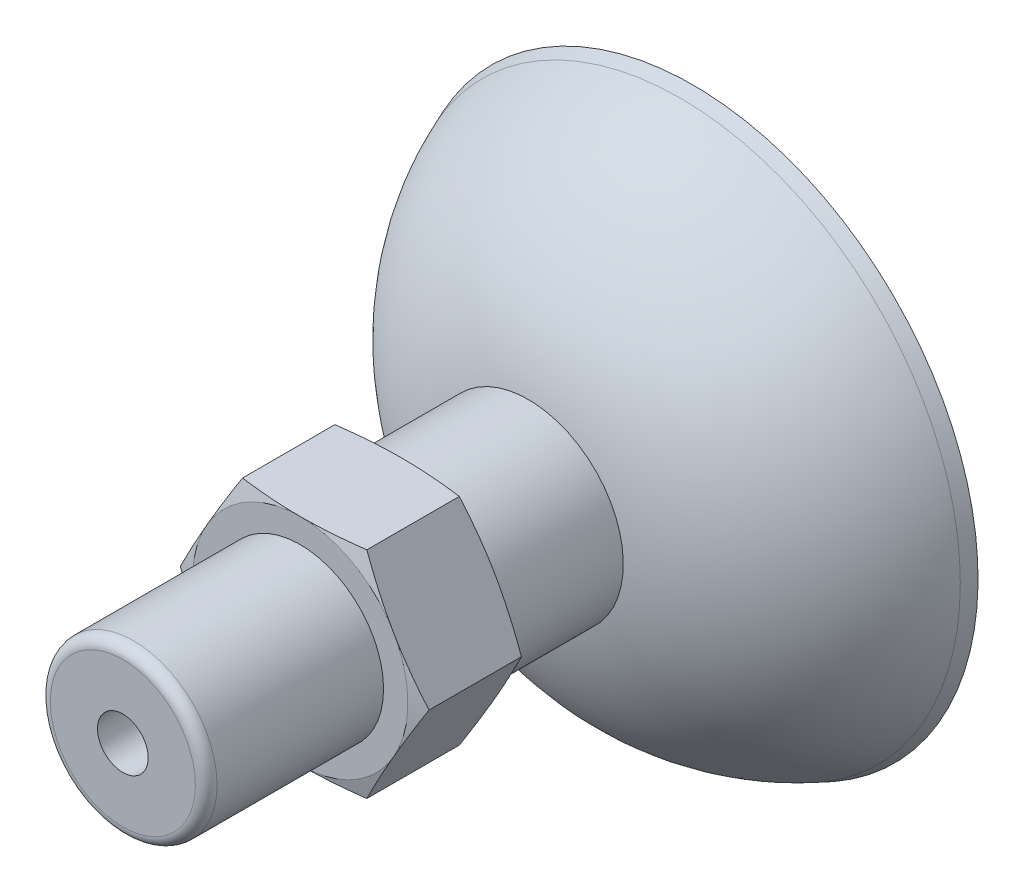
ISO-10303-21;
HEADER;
FILE_DESCRIPTION(('STEP AP214'),'2;1');
FILE_NAME('part.step','',(''),(''),'','','');
FILE_SCHEMA(('AUTOMOTIVE_DESIGN { 1 0 10303 214 1 1 1 1 }'));
ENDSEC;
DATA;
#1=APPLICATION_CONTEXT('core data for automotive mechanical design processes');
#2=APPLICATION_PROTOCOL_DEFINITION('international standard','automotive_design',2000,#1);
#3=PRODUCT_CONTEXT('',#1,'mechanical');
#4=PRODUCT('Part','Part','',(#3));
#5=PRODUCT_RELATED_PRODUCT_CATEGORY('part','',(#4));
#6=PRODUCT_DEFINITION_FORMATION('','',#4);
#7=PRODUCT_DEFINITION_CONTEXT('part definition',#1,'design');
#8=PRODUCT_DEFINITION('design','',#6,#7);
#9=PRODUCT_DEFINITION_SHAPE('','',#8);
#10=(LENGTH_UNIT() NAMED_UNIT(*) SI_UNIT(.MILLI.,.METRE.));
#11=(NAMED_UNIT(*) PLANE_ANGLE_UNIT() SI_UNIT($,.RADIAN.));
#12=(NAMED_UNIT(*) SI_UNIT($,.STERADIAN.) SOLID_ANGLE_UNIT());
#13=UNCERTAINTY_MEASURE_WITH_UNIT(LENGTH_MEASURE(1.E-05),#10,'distance_accuracy_value','');
#14=(GEOMETRIC_REPRESENTATION_CONTEXT(3) GLOBAL_UNCERTAINTY_ASSIGNED_CONTEXT((#13)) GLOBAL_UNIT_ASSIGNED_CONTEXT((#10,
#11,#12)) REPRESENTATION_CONTEXT('',''));
#15=CARTESIAN_POINT('',(0.,0.,0.));
#16=DIRECTION('',(0.,0.,1.));
#17=DIRECTION('',(1.,0.,0.));
#18=AXIS2_PLACEMENT_3D('',#15,#16,#17);
#19=CARTESIAN_POINT('',(9.81495457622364,0.,23.));
#20=DIRECTION('',(0.866025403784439,0.5,0.));
#21=DIRECTION('',(0.,0.,1.));
#22=AXIS2_PLACEMENT_3D('',#19,#20,#21);
#23=PLANE('',#22);
#24=DIRECTION('',(0.,0.,1.));
#25=VECTOR('',#24,1.);
#26=CARTESIAN_POINT('',(4.90747728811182,8.5,23.));
#27=LINE('',#26,#25);
#28=CARTESIAN_POINT('',(4.90747728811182,8.5,23.3523410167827));
#29=VERTEX_POINT('',#28);
#30=CARTESIAN_POINT('',(4.90747728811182,8.5,30.6476589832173));
#31=VERTEX_POINT('',#30);
#32=EDGE_CURVE('E155',#29,#31,#27,.T.);
#33=ORIENTED_EDGE('',*,*,#32,.T.);
#34=CARTESIAN_POINT('',(7.36121593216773,4.25000000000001,31.));
#35=CARTESIAN_POINT('',(7.25906175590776,4.42681371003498,31.0000283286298));
#36=CARTESIAN_POINT('',(7.15683049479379,4.60358298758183,30.9980853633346));
#37=CARTESIAN_POINT('',(6.95297562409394,4.95616774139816,30.9903015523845));
#38=CARTESIAN_POINT('',(6.85135160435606,5.1319834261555,30.9844809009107));
#39=CARTESIAN_POINT('',(6.64789890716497,5.4845122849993,30.9689468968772));
#40=CARTESIAN_POINT('',(6.54607179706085,5.66122549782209,30.9592139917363));
#41=CARTESIAN_POINT('',(6.34102365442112,6.01708320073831,30.9359159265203));
#42=CARTESIAN_POINT('',(6.23780425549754,6.19622503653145,30.92229626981));
#43=CARTESIAN_POINT('',(6.03399427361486,6.54934217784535,30.8919827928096));
#44=CARTESIAN_POINT('',(5.93340724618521,6.72332747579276,30.8753809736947));
#45=CARTESIAN_POINT('',(5.73149806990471,7.07269913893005,30.8388368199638));
#46=CARTESIAN_POINT('',(5.63017779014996,7.24808347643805,30.8188648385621));
#47=CARTESIAN_POINT('',(5.42622044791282,7.60127476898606,30.7756107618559));
#48=CARTESIAN_POINT('',(5.32358676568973,7.77907804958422,30.7522829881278));
#49=CARTESIAN_POINT('',(5.11643524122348,8.13798036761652,30.7023308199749));
#50=CARTESIAN_POINT('',(5.01192109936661,8.31907363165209,30.6756494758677));
#51=CARTESIAN_POINT('',(4.90747728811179,8.49999999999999,30.6476589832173));
#52=B_SPLINE_CURVE_WITH_KNOTS('',3,(#34,#35,#36,#37,#38,#39,#40,#41,#42,#43,#44,#45,#46,#47,#48,
#49,#50,#51),.UNSPECIFIED.,.F.,.F.,(4,2,2,2,2,2,2,2,4),(0.,0.612597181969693,1.22202876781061,
1.83454479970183,2.45611071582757,3.0610462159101,3.67161078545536,4.29145119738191,
4.92377991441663),.UNSPECIFIED.);
#53=CARTESIAN_POINT('',(7.36121593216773,4.25,31.));
#54=VERTEX_POINT('',#53);
#55=EDGE_CURVE('E159',#54,#31,#52,.T.);
#56=ORIENTED_EDGE('',*,*,#55,.F.);
#57=CARTESIAN_POINT('',(9.81495457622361,0.,30.6476589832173));
#58=CARTESIAN_POINT('',(9.71049903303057,0.180898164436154,30.6756469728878));
#59=CARTESIAN_POINT('',(9.60593547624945,0.36194148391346,30.7023256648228));
#60=CARTESIAN_POINT('',(9.39870838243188,0.720772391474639,30.7522744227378));
#61=CARTESIAN_POINT('',(9.29604797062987,0.898553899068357,30.7756012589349));
#62=CARTESIAN_POINT('',(9.09215663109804,1.25178452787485,30.8188552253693));
#63=CARTESIAN_POINT('',(8.99092720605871,1.42722891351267,30.8388278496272));
#64=CARTESIAN_POINT('',(8.78930184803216,1.77679219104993,30.875375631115));
#65=CARTESIAN_POINT('',(8.68890677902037,1.95090849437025,30.8919802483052));
#66=CARTESIAN_POINT('',(8.48499517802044,2.30396626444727,30.9222962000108));
#67=CARTESIAN_POINT('',(8.38146828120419,2.48290963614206,30.9359161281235));
#68=CARTESIAN_POINT('',(8.1758194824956,2.83839265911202,30.9592144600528));
#69=CARTESIAN_POINT('',(8.07369897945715,3.01492953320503,30.9689471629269));
#70=CARTESIAN_POINT('',(7.87012962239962,3.36739105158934,30.9844810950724));
#71=CARTESIAN_POINT('',(7.7686799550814,3.54331437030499,30.9903016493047));
#72=CARTESIAN_POINT('',(7.56525161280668,3.89617326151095,30.9980854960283));
#73=CARTESIAN_POINT('',(7.46327295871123,4.07310929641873,31.0000283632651));
#74=CARTESIAN_POINT('',(7.36121593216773,4.25000000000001,31.));
#75=B_SPLINE_CURVE_WITH_KNOTS('',3,(#57,#58,#59,#60,#61,#62,#63,#64,#65,#66,#67,#68,#69,#70,#71,
#72,#73,#74),.UNSPECIFIED.,.F.,.F.,(4,2,2,2,2,2,2,2,4),(0.,0.632272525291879,1.25209624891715,
1.86268065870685,2.46766909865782,3.08918081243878,3.70167875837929,4.31112844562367,
4.92377995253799),.UNSPECIFIED.);
#76=CARTESIAN_POINT('',(9.81495457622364,0.,30.6476589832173));
#77=VERTEX_POINT('',#76);
#78=EDGE_CURVE('E189',#77,#54,#75,.T.);
#79=ORIENTED_EDGE('',*,*,#78,.F.);
#80=DIRECTION('',(0.,0.,1.));
#81=VECTOR('',#80,1.);
#82=CARTESIAN_POINT('',(9.81495457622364,0.,23.));
#83=LINE('',#82,#81);
#84=CARTESIAN_POINT('',(9.81495457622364,0.,23.3523410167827));
#85=VERTEX_POINT('',#84);
#86=EDGE_CURVE('E239',#85,#77,#83,.T.);
#87=ORIENTED_EDGE('',*,*,#86,.F.);
#88=CARTESIAN_POINT('',(7.36121593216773,4.25000000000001,23.));
#89=CARTESIAN_POINT('',(7.46326400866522,4.07312503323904,22.9999716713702));
#90=CARTESIAN_POINT('',(7.56523506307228,3.89620552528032,23.0019146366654));
#91=CARTESIAN_POINT('',(7.76865498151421,3.54336965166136,23.0096984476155));
#92=CARTESIAN_POINT('',(7.87010382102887,3.36745282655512,23.0155190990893));
#93=CARTESIAN_POINT('',(8.07367641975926,3.0149931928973,23.0310531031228));
#94=CARTESIAN_POINT('',(8.17580099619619,2.83845172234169,23.0407860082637));
#95=CARTESIAN_POINT('',(8.38145873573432,2.4829459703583,23.0640840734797));
#96=CARTESIAN_POINT('',(8.48499041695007,2.30398443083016,23.07770373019));
#97=CARTESIAN_POINT('',(8.68889384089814,1.95092123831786,23.1080172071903));
#98=CARTESIAN_POINT('',(8.78927601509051,1.77681766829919,23.1246190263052));
#99=CARTESIAN_POINT('',(8.99088616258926,1.42727336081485,23.161163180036));
#100=CARTESIAN_POINT('',(9.09211331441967,1.25183525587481,23.1811351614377));
#101=CARTESIAN_POINT('',(9.29600727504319,0.898607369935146,23.2243892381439));
#102=CARTESIAN_POINT('',(9.39867259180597,0.720822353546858,23.247717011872));
#103=CARTESIAN_POINT('',(9.60591535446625,0.36197271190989,23.297669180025));
#104=CARTESIAN_POINT('',(9.71048965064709,0.180914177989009,23.3243505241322));
#105=CARTESIAN_POINT('',(9.81495457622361,0.,23.3523410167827));
#106=B_SPLINE_CURVE_WITH_KNOTS('',3,(#88,#89,#90,#91,#92,#93,#94,#95,#96,#97,#98,#99,#100,#101,
#102,#103,#104,#105),.UNSPECIFIED.,.F.,.F.,(4,2,2,2,2,2,2,2,4),(0.,0.612597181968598,
1.22202876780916,1.83454479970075,2.45611071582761,3.06104621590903,3.67161078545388,
4.29145119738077,4.92377991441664),.UNSPECIFIED.);
#107=CARTESIAN_POINT('',(7.36121593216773,4.25,23.));
#108=VERTEX_POINT('',#107);
#109=EDGE_CURVE('E243',#108,#85,#106,.T.);
#110=ORIENTED_EDGE('',*,*,#109,.F.);
#111=CARTESIAN_POINT('',(4.90747728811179,8.49999999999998,23.3523410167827));
#112=CARTESIAN_POINT('',(5.01191192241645,8.319089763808,23.3243530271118));
#113=CARTESIAN_POINT('',(5.11641825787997,8.13801340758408,23.2976743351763));
#114=CARTESIAN_POINT('',(5.32356139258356,7.77913402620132,23.2477255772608));
#115=CARTESIAN_POINT('',(5.4261944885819,7.60133674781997,23.2243987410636));
#116=CARTESIAN_POINT('',(5.63015551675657,7.24814635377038,23.1811447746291));
#117=CARTESIAN_POINT('',(5.73148009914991,7.07275690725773,23.1611721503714));
#118=CARTESIAN_POINT('',(5.93339809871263,6.72336258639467,23.1246243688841));
#119=CARTESIAN_POINT('',(6.03398970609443,6.54935975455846,23.1080197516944));
#120=CARTESIAN_POINT('',(6.23779090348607,6.19623824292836,23.0777037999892));
#121=CARTESIAN_POINT('',(6.34099696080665,6.01710963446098,23.0640838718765));
#122=CARTESIAN_POINT('',(6.5460298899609,5.66127103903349,23.0407855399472));
#123=CARTESIAN_POINT('',(6.64785505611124,5.4845636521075,23.0310528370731));
#124=CARTESIAN_POINT('',(6.85131100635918,5.13203665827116,23.0155189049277));
#125=CARTESIAN_POINT('',(6.95294023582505,4.95621700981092,23.0096983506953));
#126=CARTESIAN_POINT('',(7.15681082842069,4.60361345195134,23.0019145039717));
#127=CARTESIAN_POINT('',(7.25905260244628,4.42682932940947,22.9999716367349));
#128=CARTESIAN_POINT('',(7.36121593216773,4.25000000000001,23.));
#129=B_SPLINE_CURVE_WITH_KNOTS('',3,(#111,#112,#113,#114,#115,#116,#117,#118,#119,#120,#121,
#122,#123,#124,#125,#126,#127,#128),.UNSPECIFIED.,.F.,.F.,(4,2,2,2,2,2,2,2,4),(0.,
0.632272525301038,1.25209624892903,1.86268065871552,2.46766909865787,3.08918081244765,
3.7016787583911,4.31112844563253,4.92377995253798),.UNSPECIFIED.);
#130=EDGE_CURVE('E163',#29,#108,#129,.T.);
#131=ORIENTED_EDGE('',*,*,#130,.F.);
#132=EDGE_LOOP('',(#33,#56,#79,#87,#110,#131));
#133=FACE_BOUND('',#132,.T.);
#134=ADVANCED_FACE('F16',(#133),#23,.T.);
#135=CARTESIAN_POINT('',(4.90747728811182,8.5,23.));
#136=DIRECTION('',(0.,1.,0.));
#137=DIRECTION('',(-1.,0.,0.));
#138=AXIS2_PLACEMENT_3D('',#135,#136,#137);
#139=PLANE('',#138);
#140=DIRECTION('',(0.,0.,1.));
#141=VECTOR('',#140,1.);
#142=CARTESIAN_POINT('',(-4.90747728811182,8.5,23.));
#143=LINE('',#142,#141);
#144=CARTESIAN_POINT('',(-4.90747728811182,8.5,23.3523410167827));
#145=VERTEX_POINT('',#144);
#146=CARTESIAN_POINT('',(-4.90747728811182,8.5,30.6476589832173));
#147=VERTEX_POINT('',#146);
#148=EDGE_CURVE('E169',#145,#147,#143,.T.);
#149=ORIENTED_EDGE('',*,*,#148,.T.);
#150=CARTESIAN_POINT('',(0.,8.50000000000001,31.));
#151=CARTESIAN_POINT('',(-0.204176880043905,8.49993864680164,31.000028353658));
#152=CARTESIAN_POINT('',(-0.408353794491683,8.4997949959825,30.9980841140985));
#153=CARTESIAN_POINT('',(-0.815609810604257,8.49956334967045,30.9902964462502));
#154=CARTESIAN_POINT('',(-1.01868928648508,8.49947507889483,30.9844726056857));
#155=CARTESIAN_POINT('',(-1.42576127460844,8.49956968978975,30.9689308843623));
#156=CARTESIAN_POINT('',(-1.6297530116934,8.49975399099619,30.959192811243));
#157=CARTESIAN_POINT('',(-2.04057387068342,8.50012267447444,30.9358833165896));
#158=CARTESIAN_POINT('',(-2.24739984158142,8.50030701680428,30.9222567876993));
#159=CARTESIAN_POINT('',(-2.65519984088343,8.50035684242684,30.8919349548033));
#160=CARTESIAN_POINT('',(-2.85618081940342,8.50023081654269,30.8753326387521));
#161=CARTESIAN_POINT('',(-3.2597010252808,8.50003909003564,30.8387900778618));
#162=CARTESIAN_POINT('',(-3.46223759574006,8.49997395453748,30.8188205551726));
#163=CARTESIAN_POINT('',(-3.87004259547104,8.49991499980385,30.775574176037));
#164=CARTESIAN_POINT('',(-4.07530619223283,8.49992227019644,30.752252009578));
#165=CARTESIAN_POINT('',(-4.48960341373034,8.49995838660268,30.7023138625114));
#166=CARTESIAN_POINT('',(-4.69863023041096,8.49998766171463,30.6756412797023));
#167=CARTESIAN_POINT('',(-4.90747728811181,8.5,30.6476589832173));
#168=B_SPLINE_CURVE_WITH_KNOTS('',3,(#150,#151,#152,#153,#154,#155,#156,#157,#158,#159,#160,
#161,#162,#163,#164,#165,#166,#167),.UNSPECIFIED.,.F.,.F.,(4,2,2,2,2,2,2,2,4),(0.,
0.612521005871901,1.22197265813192,1.83460948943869,2.4564009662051,3.06137183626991,
3.67190327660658,4.29163625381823,4.92377827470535),.UNSPECIFIED.);
#169=CARTESIAN_POINT('',(0.,8.5,31.));
#170=VERTEX_POINT('',#169);
#171=EDGE_CURVE('E177',#170,#147,#168,.T.);
#172=ORIENTED_EDGE('',*,*,#171,.F.);
#173=CARTESIAN_POINT('',(4.9074772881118,8.50000000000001,30.6476589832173));
#174=CARTESIAN_POINT('',(4.69946398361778,8.49998809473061,30.6755294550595));
#175=CARTESIAN_POINT('',(4.49127255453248,8.49995395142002,30.7021019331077));
#176=CARTESIAN_POINT('',(4.07863628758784,8.49990114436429,30.7518671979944));
#177=CARTESIAN_POINT('',(3.87419820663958,8.49988218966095,30.775116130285));
#178=CARTESIAN_POINT('',(3.46804768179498,8.49991440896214,30.8182431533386));
#179=CARTESIAN_POINT('',(3.26634005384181,8.49996454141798,30.838166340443));
#180=CARTESIAN_POINT('',(2.86449662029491,8.50012588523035,30.8746436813));
#181=CARTESIAN_POINT('',(2.66436348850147,8.50023652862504,30.8912272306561));
#182=CARTESIAN_POINT('',(2.25663453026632,8.50017221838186,30.9216619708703));
#183=CARTESIAN_POINT('',(2.04902969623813,8.49998682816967,30.9353931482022));
#184=CARTESIAN_POINT('',(1.63662828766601,8.49963276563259,30.9588816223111));
#185=CARTESIAN_POINT('',(1.43183486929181,8.49946388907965,30.968693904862));
#186=CARTESIAN_POINT('',(1.02311579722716,8.49940595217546,30.98435467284));
#187=CARTESIAN_POINT('',(0.819190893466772,8.49951550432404,30.9902226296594));
#188=CARTESIAN_POINT('',(0.41017756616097,8.49978124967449,30.9980701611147));
#189=CARTESIAN_POINT('',(0.205088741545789,8.4999376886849,31.0000288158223));
#190=CARTESIAN_POINT('',(0.,8.50000000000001,31.));
#191=B_SPLINE_CURVE_WITH_KNOTS('',3,(#173,#174,#175,#176,#177,#178,#179,#180,#181,#182,#183,
#184,#185,#186,#187,#188,#189,#190),.UNSPECIFIED.,.F.,.F.,(4,2,2,2,2,2,2,2,4),(0.,
0.629618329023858,1.24686607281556,1.8549093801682,2.45734110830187,3.08148436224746,
3.69653362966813,4.30852392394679,4.92378048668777),.UNSPECIFIED.);
#192=EDGE_CURVE('E173',#31,#170,#191,.T.);
#193=ORIENTED_EDGE('',*,*,#192,.F.);
#194=ORIENTED_EDGE('',*,*,#32,.F.);
#195=CARTESIAN_POINT('',(0.,8.5,23.));
#196=CARTESIAN_POINT('',(0.204176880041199,8.49993864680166,22.999971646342));
#197=CARTESIAN_POINT('',(0.408353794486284,8.49979499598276,23.0019158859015));
#198=CARTESIAN_POINT('',(0.81560981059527,8.49956334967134,23.0097035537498));
#199=CARTESIAN_POINT('',(1.0186892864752,8.4994750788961,23.0155273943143));
#200=CARTESIAN_POINT('',(1.42576127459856,8.49956968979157,23.0310691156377));
#201=CARTESIAN_POINT('',(1.62975301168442,8.4997539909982,23.0408071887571));
#202=CARTESIAN_POINT('',(2.04057387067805,8.5001226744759,23.0641166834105));
#203=CARTESIAN_POINT('',(2.24739984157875,8.500307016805,23.0777432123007));
#204=CARTESIAN_POINT('',(2.65519984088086,8.50035684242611,23.1080650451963));
#205=CARTESIAN_POINT('',(2.85618081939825,8.50023081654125,23.1246673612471));
#206=CARTESIAN_POINT('',(3.25970102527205,8.50003909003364,23.1612099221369));
#207=CARTESIAN_POINT('',(3.46223759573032,8.49997395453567,23.181179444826));
#208=CARTESIAN_POINT('',(3.87004259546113,8.49991499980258,23.2244258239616));
#209=CARTESIAN_POINT('',(4.07530619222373,8.49992227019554,23.2477479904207));
#210=CARTESIAN_POINT('',(4.48960341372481,8.49995838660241,23.2976861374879));
#211=CARTESIAN_POINT('',(4.69863023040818,8.49998766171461,23.3243587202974));
#212=CARTESIAN_POINT('',(4.9074772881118,8.50000000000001,23.3523410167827));
#213=B_SPLINE_CURVE_WITH_KNOTS('',3,(#195,#196,#197,#198,#199,#200,#201,#202,#203,#204,#205,
#206,#207,#208,#209,#210,#211,#212),.UNSPECIFIED.,.F.,.F.,(4,2,2,2,2,2,2,2,4),(0.,
0.612521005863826,1.22197265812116,1.83460948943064,2.45640096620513,3.06137183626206,
3.67190327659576,4.29163625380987,4.92377827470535),.UNSPECIFIED.);
#214=CARTESIAN_POINT('',(0.,8.5,23.));
#215=VERTEX_POINT('',#214);
#216=EDGE_CURVE('E288',#215,#29,#213,.T.);
#217=ORIENTED_EDGE('',*,*,#216,.F.);
#218=CARTESIAN_POINT('',(-4.90747728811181,8.49999999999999,23.3523410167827));
#219=CARTESIAN_POINT('',(-4.69946398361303,8.49998809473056,23.3244705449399));
#220=CARTESIAN_POINT('',(-4.49127255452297,8.49995395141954,23.297898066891));
#221=CARTESIAN_POINT('',(-4.07863628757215,8.49990114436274,23.2481328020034));
#222=CARTESIAN_POINT('',(-3.87419820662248,8.49988218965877,23.2248838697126));
#223=CARTESIAN_POINT('',(-3.46804768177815,8.49991440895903,23.181756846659));
#224=CARTESIAN_POINT('',(-3.26634005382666,8.49996454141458,23.1618336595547));
#225=CARTESIAN_POINT('',(-2.86449662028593,8.50012588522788,23.1253563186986));
#226=CARTESIAN_POINT('',(-2.66436348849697,8.5002365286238,23.1087727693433));
#227=CARTESIAN_POINT('',(-2.25663453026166,8.50017221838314,23.0783380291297));
#228=CARTESIAN_POINT('',(-2.04902969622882,8.49998682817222,23.0646068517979));
#229=CARTESIAN_POINT('',(-1.63662828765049,8.49963276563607,23.041118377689));
#230=CARTESIAN_POINT('',(-1.43183486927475,8.49946388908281,23.031306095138));
#231=CARTESIAN_POINT('',(-1.0231157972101,8.49940595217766,23.01564532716));
#232=CARTESIAN_POINT('',(-0.819190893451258,8.49951550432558,23.0097773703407));
#233=CARTESIAN_POINT('',(-0.410177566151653,8.49978124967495,23.0019298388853));
#234=CARTESIAN_POINT('',(-0.205088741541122,8.49993768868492,22.9999711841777));
#235=CARTESIAN_POINT('',(0.,8.5,23.));
#236=B_SPLINE_CURVE_WITH_KNOTS('',3,(#218,#219,#220,#221,#222,#223,#224,#225,#226,#227,#228,
#229,#230,#231,#232,#233,#234,#235),.UNSPECIFIED.,.F.,.F.,(4,2,2,2,2,2,2,2,4),(0.,
0.629618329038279,1.24686607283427,1.85490938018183,2.45734110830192,3.08148436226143,
3.69653362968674,4.30852392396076,4.92378048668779),.UNSPECIFIED.);
#237=EDGE_CURVE('E1017',#145,#215,#236,.T.);
#238=ORIENTED_EDGE('',*,*,#237,.F.);
#239=EDGE_LOOP('',(#149,#172,#193,#194,#217,#238));
#240=FACE_BOUND('',#239,.T.);
#241=ADVANCED_FACE('F175',(#240),#139,.T.);
#242=CARTESIAN_POINT('',(-4.90747728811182,8.5,23.));
#243=DIRECTION('',(-0.866025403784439,0.5,0.));
#244=DIRECTION('',(0.,0.,-1.));
#245=AXIS2_PLACEMENT_3D('',#242,#243,#244);
#246=PLANE('',#245);
#247=DIRECTION('',(0.,0.,1.));
#248=VECTOR('',#247,1.);
#249=CARTESIAN_POINT('',(-9.81495457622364,0.,23.));
#250=LINE('',#249,#248);
#251=CARTESIAN_POINT('',(-9.81495457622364,0.,23.3523410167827));
#252=VERTEX_POINT('',#251);
#253=CARTESIAN_POINT('',(-9.81495457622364,0.,30.6476589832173));
#254=VERTEX_POINT('',#253);
#255=EDGE_CURVE('E472',#252,#254,#250,.T.);
#256=ORIENTED_EDGE('',*,*,#255,.T.);
#257=CARTESIAN_POINT('',(-7.36121593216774,4.25,31.));
#258=CARTESIAN_POINT('',(-7.46326400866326,4.07312503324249,31.0000283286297));
#259=CARTESIAN_POINT('',(-7.56523506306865,3.89620552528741,30.9980853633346));
#260=CARTESIAN_POINT('',(-7.76865498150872,3.54336965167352,30.9903015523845));
#261=CARTESIAN_POINT('',(-7.8701038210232,3.36745282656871,30.9844809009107));
#262=CARTESIAN_POINT('',(-8.0736764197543,3.01499319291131,30.9689468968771));
#263=CARTESIAN_POINT('',(-8.17580099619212,2.83845172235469,30.9592139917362));
#264=CARTESIAN_POINT('',(-8.38145873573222,2.48294597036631,30.9359159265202));
#265=CARTESIAN_POINT('',(-8.48499041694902,2.30398443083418,30.9222962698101));
#266=CARTESIAN_POINT('',(-8.68889384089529,1.95092123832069,30.8919827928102));
#267=CARTESIAN_POINT('',(-8.78927601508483,1.77681766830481,30.875380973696));
#268=CARTESIAN_POINT('',(-8.99088616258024,1.42727336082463,30.838836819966));
#269=CARTESIAN_POINT('',(-9.09211331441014,1.25183525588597,30.8188648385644));
#270=CARTESIAN_POINT('',(-9.29600727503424,0.898607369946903,30.7756107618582));
#271=CARTESIAN_POINT('',(-9.3986725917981,0.720822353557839,30.7522829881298));
#272=CARTESIAN_POINT('',(-9.60591535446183,0.361972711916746,30.7023308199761));
#273=CARTESIAN_POINT('',(-9.71048965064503,0.180914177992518,30.6756494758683));
#274=CARTESIAN_POINT('',(-9.81495457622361,0.,30.6476589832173));
#275=B_SPLINE_CURVE_WITH_KNOTS('',3,(#257,#258,#259,#260,#261,#262,#263,#264,#265,#266,#267,
#268,#269,#270,#271,#272,#273,#274),.UNSPECIFIED.,.F.,.F.,(4,2,2,2,2,2,2,2,4),(0.,
0.612597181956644,1.22202876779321,1.83454479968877,2.45611071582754,3.06104621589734,
3.67161078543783,4.2914511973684,4.92377991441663),.UNSPECIFIED.);
#276=CARTESIAN_POINT('',(-7.36121593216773,4.25,31.));
#277=VERTEX_POINT('',#276);
#278=EDGE_CURVE('E494',#277,#254,#275,.T.);
#279=ORIENTED_EDGE('',*,*,#278,.F.);
#280=CARTESIAN_POINT('',(-4.9074772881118,8.49999999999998,30.6476589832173));
#281=CARTESIAN_POINT('',(-5.01191192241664,8.31908976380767,30.6756469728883));
#282=CARTESIAN_POINT('',(-5.11641825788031,8.13801340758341,30.7023256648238));
#283=CARTESIAN_POINT('',(-5.32356139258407,7.77913402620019,30.7522744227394));
#284=CARTESIAN_POINT('',(-5.42619448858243,7.60133674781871,30.7756012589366));
#285=CARTESIAN_POINT('',(-5.63015551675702,7.24814635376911,30.8188552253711));
#286=CARTESIAN_POINT('',(-5.73148009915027,7.07275690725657,30.8388278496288));
#287=CARTESIAN_POINT('',(-5.9333980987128,6.72336258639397,30.875375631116));
#288=CARTESIAN_POINT('',(-6.0339897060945,6.54935975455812,30.8919802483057));
#289=CARTESIAN_POINT('',(-6.23779090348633,6.19623824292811,30.9222962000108));
#290=CARTESIAN_POINT('',(-6.34099696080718,6.01710963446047,30.9359161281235));
#291=CARTESIAN_POINT('',(-6.54602988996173,5.66127103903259,30.9592144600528));
#292=CARTESIAN_POINT('',(-6.64785505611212,5.48456365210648,30.9689471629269));
#293=CARTESIAN_POINT('',(-6.85131100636,5.13203665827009,30.9844810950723));
#294=CARTESIAN_POINT('',(-6.95294023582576,4.95621700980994,30.9903016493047));
#295=CARTESIAN_POINT('',(-7.15681082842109,4.60361345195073,30.9980854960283));
#296=CARTESIAN_POINT('',(-7.25905260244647,4.42682932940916,31.0000283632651));
#297=CARTESIAN_POINT('',(-7.36121593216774,4.25,31.));
#298=B_SPLINE_CURVE_WITH_KNOTS('',3,(#280,#281,#282,#283,#284,#285,#286,#287,#288,#289,#290,
#291,#292,#293,#294,#295,#296,#297),.UNSPECIFIED.,.F.,.F.,(4,2,2,2,2,2,2,2,4),(0.,
0.632272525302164,1.2520962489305,1.86268065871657,2.46766909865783,3.08918081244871,
3.70167875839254,4.31112844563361,4.92377995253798),.UNSPECIFIED.);
#299=EDGE_CURVE('E404',#147,#277,#298,.T.);
#300=ORIENTED_EDGE('',*,*,#299,.F.);
#301=ORIENTED_EDGE('',*,*,#148,.F.);
#302=CARTESIAN_POINT('',(-7.36121593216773,4.25,23.));
#303=CARTESIAN_POINT('',(-7.25906175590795,4.42681371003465,22.9999716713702));
#304=CARTESIAN_POINT('',(-7.15683049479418,4.6035829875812,23.0019146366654));
#305=CARTESIAN_POINT('',(-6.95297562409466,4.95616774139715,23.0096984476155));
#306=CARTESIAN_POINT('',(-6.85135160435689,5.13198342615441,23.0155190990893));
#307=CARTESIAN_POINT('',(-6.64789890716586,5.48451228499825,23.0310531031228));
#308=CARTESIAN_POINT('',(-6.5460717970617,5.66122549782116,23.0407860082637));
#309=CARTESIAN_POINT('',(-6.34102365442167,6.01708320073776,23.0640840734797));
#310=CARTESIAN_POINT('',(-6.23780425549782,6.19622503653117,23.07770373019));
#311=CARTESIAN_POINT('',(-6.03399427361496,6.54934217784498,23.1080172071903));
#312=CARTESIAN_POINT('',(-5.93340724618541,6.72332747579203,23.1246190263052));
#313=CARTESIAN_POINT('',(-5.73149806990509,7.07269913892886,23.161163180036));
#314=CARTESIAN_POINT('',(-5.63017779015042,7.24808347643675,23.1811351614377));
#315=CARTESIAN_POINT('',(-5.42622044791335,7.60127476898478,23.2243892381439));
#316=CARTESIAN_POINT('',(-5.32358676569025,7.77907804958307,23.247717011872));
#317=CARTESIAN_POINT('',(-5.11643524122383,8.13798036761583,23.297669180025));
#318=CARTESIAN_POINT('',(-5.0119210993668,8.31907363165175,23.3243505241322));
#319=CARTESIAN_POINT('',(-4.9074772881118,8.49999999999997,23.3523410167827));
#320=B_SPLINE_CURVE_WITH_KNOTS('',3,(#302,#303,#304,#305,#306,#307,#308,#309,#310,#311,#312,
#313,#314,#315,#316,#317,#318,#319),.UNSPECIFIED.,.F.,.F.,(4,2,2,2,2,2,2,2,4),(0.,
0.612597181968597,1.22202876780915,1.83454479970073,2.45611071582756,3.06104621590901,
3.67161078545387,4.29145119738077,4.92377991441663),.UNSPECIFIED.);
#321=CARTESIAN_POINT('',(-7.36121593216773,4.25,23.));
#322=VERTEX_POINT('',#321);
#323=EDGE_CURVE('E133',#322,#145,#320,.T.);
#324=ORIENTED_EDGE('',*,*,#323,.F.);
#325=CARTESIAN_POINT('',(-9.81495457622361,0.,23.3523410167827));
#326=CARTESIAN_POINT('',(-9.71049903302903,0.18089816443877,23.3243530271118));
#327=CARTESIAN_POINT('',(-9.60593547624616,0.361941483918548,23.2976743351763));
#328=CARTESIAN_POINT('',(-9.39870838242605,0.720772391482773,23.2477255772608));
#329=CARTESIAN_POINT('',(-9.29604797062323,0.898553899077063,23.2243987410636));
#330=CARTESIAN_POINT('',(-9.09215663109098,1.25178452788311,23.1811447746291));
#331=CARTESIAN_POINT('',(-8.99092720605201,1.42722891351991,23.1611721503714));
#332=CARTESIAN_POINT('',(-8.78930184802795,1.77679219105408,23.1246243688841));
#333=CARTESIAN_POINT('',(-8.68890677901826,1.95090849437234,23.1080197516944));
#334=CARTESIAN_POINT('',(-8.48499517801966,2.30396626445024,23.0777037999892));
#335=CARTESIAN_POINT('',(-8.38146828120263,2.48290963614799,23.0640838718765));
#336=CARTESIAN_POINT('',(-8.17581948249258,2.83839265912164,23.0407855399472));
#337=CARTESIAN_POINT('',(-8.07369897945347,3.0149295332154,23.0310528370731));
#338=CARTESIAN_POINT('',(-7.87012962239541,3.3673910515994,23.0155189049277));
#339=CARTESIAN_POINT('',(-7.76867995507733,3.54331437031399,23.0096983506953));
#340=CARTESIAN_POINT('',(-7.56525161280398,3.8961732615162,23.0019145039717));
#341=CARTESIAN_POINT('',(-7.46327295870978,4.07310929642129,22.9999716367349));
#342=CARTESIAN_POINT('',(-7.36121593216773,4.25,23.));
#343=B_SPLINE_CURVE_WITH_KNOTS('',3,(#325,#326,#327,#328,#329,#330,#331,#332,#333,#334,#335,
#336,#337,#338,#339,#340,#341,#342),.UNSPECIFIED.,.F.,.F.,(4,2,2,2,2,2,2,2,4),(0.,
0.632272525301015,1.25209624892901,1.86268065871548,2.46766909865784,3.08918081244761,
3.70167875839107,4.3111284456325,4.92377995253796),.UNSPECIFIED.);
#344=EDGE_CURVE('E1020',#252,#322,#343,.T.);
#345=ORIENTED_EDGE('',*,*,#344,.F.);
#346=EDGE_LOOP('',(#256,#279,#300,#301,#324,#345));
#347=FACE_BOUND('',#346,.T.);
#348=ADVANCED_FACE('F377',(#347),#246,.T.);
#349=CARTESIAN_POINT('',(-9.81495457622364,0.,23.));
#350=DIRECTION('',(-0.866025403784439,-0.5,0.));
#351=DIRECTION('',(0.,0.,-1.));
#352=AXIS2_PLACEMENT_3D('',#349,#350,#351);
#353=PLANE('',#352);
#354=DIRECTION('',(0.,0.,1.));
#355=VECTOR('',#354,1.);
#356=CARTESIAN_POINT('',(-4.90747728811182,-8.5,23.));
#357=LINE('',#356,#355);
#358=CARTESIAN_POINT('',(-4.90747728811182,-8.5,23.3523410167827));
#359=VERTEX_POINT('',#358);
#360=CARTESIAN_POINT('',(-4.90747728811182,-8.5,30.6476589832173));
#361=VERTEX_POINT('',#360);
#362=EDGE_CURVE('E121',#359,#361,#357,.T.);
#363=ORIENTED_EDGE('',*,*,#362,.T.);
#364=CARTESIAN_POINT('',(-7.36121593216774,-4.25,31.));
#365=CARTESIAN_POINT('',(-7.25906175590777,-4.42681371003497,31.0000283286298));
#366=CARTESIAN_POINT('',(-7.15683049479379,-4.60358298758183,30.9980853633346));
#367=CARTESIAN_POINT('',(-6.95297562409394,-4.95616774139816,30.9903015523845));
#368=CARTESIAN_POINT('',(-6.85135160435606,-5.1319834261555,30.9844809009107));
#369=CARTESIAN_POINT('',(-6.64789890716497,-5.4845122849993,30.9689468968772));
#370=CARTESIAN_POINT('',(-6.54607179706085,-5.66122549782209,30.9592139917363));
#371=CARTESIAN_POINT('',(-6.34102365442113,-6.01708320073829,30.9359159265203));
#372=CARTESIAN_POINT('',(-6.23780425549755,-6.19622503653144,30.92229626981));
#373=CARTESIAN_POINT('',(-6.03399427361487,-6.54934217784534,30.8919827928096));
#374=CARTESIAN_POINT('',(-5.93340724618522,-6.72332747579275,30.8753809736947));
#375=CARTESIAN_POINT('',(-5.73149806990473,-7.07269913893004,30.8388368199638));
#376=CARTESIAN_POINT('',(-5.63017779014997,-7.24808347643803,30.8188648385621));
#377=CARTESIAN_POINT('',(-5.42622044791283,-7.60127476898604,30.7756107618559));
#378=CARTESIAN_POINT('',(-5.32358676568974,-7.77907804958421,30.7522829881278));
#379=CARTESIAN_POINT('',(-5.1164352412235,-8.13798036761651,30.7023308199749));
#380=CARTESIAN_POINT('',(-5.01192109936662,-8.31907363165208,30.6756494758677));
#381=CARTESIAN_POINT('',(-4.90747728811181,-8.49999999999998,30.6476589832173));
#382=B_SPLINE_CURVE_WITH_KNOTS('',3,(#364,#365,#366,#367,#368,#369,#370,#371,#372,#373,#374,
#375,#376,#377,#378,#379,#380,#381),.UNSPECIFIED.,.F.,.F.,(4,2,2,2,2,2,2,2,4),(0.,
0.612597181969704,1.22202876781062,1.83454479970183,2.45611071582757,3.06104621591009,
3.67161078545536,4.29145119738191,4.92377991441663),.UNSPECIFIED.);
#383=CARTESIAN_POINT('',(-7.36121593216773,-4.25,31.));
#384=VERTEX_POINT('',#383);
#385=EDGE_CURVE('E446',#384,#361,#382,.T.);
#386=ORIENTED_EDGE('',*,*,#385,.F.);
#387=CARTESIAN_POINT('',(-9.81495457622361,0.,30.6476589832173));
#388=CARTESIAN_POINT('',(-9.71049903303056,-0.180898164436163,30.6756469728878));
#389=CARTESIAN_POINT('',(-9.60593547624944,-0.361941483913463,30.7023256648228));
#390=CARTESIAN_POINT('',(-9.39870838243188,-0.720772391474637,30.7522744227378));
#391=CARTESIAN_POINT('',(-9.29604797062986,-0.898553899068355,30.7756012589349));
#392=CARTESIAN_POINT('',(-9.09215663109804,-1.25178452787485,30.8188552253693));
#393=CARTESIAN_POINT('',(-8.9909272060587,-1.42722891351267,30.8388278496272));
#394=CARTESIAN_POINT('',(-8.78930184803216,-1.77679219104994,30.875375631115));
#395=CARTESIAN_POINT('',(-8.68890677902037,-1.95090849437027,30.8919802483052));
#396=CARTESIAN_POINT('',(-8.48499517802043,-2.30396626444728,30.9222962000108));
#397=CARTESIAN_POINT('',(-8.38146828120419,-2.48290963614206,30.9359161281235));
#398=CARTESIAN_POINT('',(-8.1758194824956,-2.83839265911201,30.9592144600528));
#399=CARTESIAN_POINT('',(-8.07369897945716,-3.01492953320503,30.9689471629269));
#400=CARTESIAN_POINT('',(-7.87012962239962,-3.36739105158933,30.9844810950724));
#401=CARTESIAN_POINT('',(-7.76867995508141,-3.54331437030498,30.9903016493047));
#402=CARTESIAN_POINT('',(-7.56525161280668,-3.89617326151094,30.9980854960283));
#403=CARTESIAN_POINT('',(-7.46327295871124,-4.07310929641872,31.0000283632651));
#404=CARTESIAN_POINT('',(-7.36121593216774,-4.25,31.));
#405=B_SPLINE_CURVE_WITH_KNOTS('',3,(#387,#388,#389,#390,#391,#392,#393,#394,#395,#396,#397,
#398,#399,#400,#401,#402,#403,#404),.UNSPECIFIED.,.F.,.F.,(4,2,2,2,2,2,2,2,4),(0.,
0.632272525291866,1.25209624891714,1.86268065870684,2.46766909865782,3.08918081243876,
3.70167875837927,4.31112844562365,4.92377995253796),.UNSPECIFIED.);
#406=EDGE_CURVE('E498',#254,#384,#405,.T.);
#407=ORIENTED_EDGE('',*,*,#406,.F.);
#408=ORIENTED_EDGE('',*,*,#255,.F.);
#409=CARTESIAN_POINT('',(-7.36121593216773,-4.24999999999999,23.));
#410=CARTESIAN_POINT('',(-7.46326400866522,-4.07312503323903,22.9999716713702));
#411=CARTESIAN_POINT('',(-7.56523506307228,-3.89620552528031,23.0019146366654));
#412=CARTESIAN_POINT('',(-7.76865498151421,-3.54336965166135,23.0096984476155));
#413=CARTESIAN_POINT('',(-7.87010382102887,-3.36745282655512,23.0155190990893));
#414=CARTESIAN_POINT('',(-8.07367641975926,-3.0149931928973,23.0310531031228));
#415=CARTESIAN_POINT('',(-8.17580099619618,-2.83845172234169,23.0407860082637));
#416=CARTESIAN_POINT('',(-8.38145873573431,-2.48294597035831,23.0640840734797));
#417=CARTESIAN_POINT('',(-8.48499041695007,-2.30398443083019,23.07770373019));
#418=CARTESIAN_POINT('',(-8.68889384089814,-1.95092123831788,23.1080172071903));
#419=CARTESIAN_POINT('',(-8.78927601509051,-1.7768176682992,23.1246190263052));
#420=CARTESIAN_POINT('',(-8.99088616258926,-1.42727336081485,23.161163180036));
#421=CARTESIAN_POINT('',(-9.09211331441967,-1.25183525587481,23.1811351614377));
#422=CARTESIAN_POINT('',(-9.29600727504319,-0.898607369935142,23.2243892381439));
#423=CARTESIAN_POINT('',(-9.39867259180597,-0.720822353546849,23.247717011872));
#424=CARTESIAN_POINT('',(-9.60591535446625,-0.361972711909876,23.297669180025));
#425=CARTESIAN_POINT('',(-9.71048965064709,-0.180914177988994,23.3243505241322));
#426=CARTESIAN_POINT('',(-9.81495457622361,0.,23.3523410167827));
#427=B_SPLINE_CURVE_WITH_KNOTS('',3,(#409,#410,#411,#412,#413,#414,#415,#416,#417,#418,#419,
#420,#421,#422,#423,#424,#425,#426),.UNSPECIFIED.,.F.,.F.,(4,2,2,2,2,2,2,2,4),(0.,
0.612597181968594,1.22202876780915,1.83454479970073,2.45611071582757,3.06104621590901,
3.67161078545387,4.29145119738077,4.92377991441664),.UNSPECIFIED.);
#428=CARTESIAN_POINT('',(-7.36121593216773,-4.25,23.));
#429=VERTEX_POINT('',#428);
#430=EDGE_CURVE('E488',#429,#252,#427,.T.);
#431=ORIENTED_EDGE('',*,*,#430,.F.);
#432=CARTESIAN_POINT('',(-4.9074772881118,-8.49999999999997,23.3523410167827));
#433=CARTESIAN_POINT('',(-5.01191192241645,-8.31908976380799,23.3243530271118));
#434=CARTESIAN_POINT('',(-5.11641825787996,-8.13801340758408,23.2976743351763));
#435=CARTESIAN_POINT('',(-5.32356139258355,-7.77913402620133,23.2477255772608));
#436=CARTESIAN_POINT('',(-5.42619448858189,-7.60133674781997,23.2243987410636));
#437=CARTESIAN_POINT('',(-5.63015551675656,-7.24814635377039,23.1811447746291));
#438=CARTESIAN_POINT('',(-5.7314800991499,-7.07275690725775,23.1611721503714));
#439=CARTESIAN_POINT('',(-5.93339809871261,-6.72336258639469,23.1246243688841));
#440=CARTESIAN_POINT('',(-6.03398970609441,-6.54935975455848,23.1080197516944));
#441=CARTESIAN_POINT('',(-6.23779090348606,-6.19623824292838,23.0777037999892));
#442=CARTESIAN_POINT('',(-6.34099696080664,-6.017109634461,23.0640838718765));
#443=CARTESIAN_POINT('',(-6.54602988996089,-5.66127103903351,23.0407855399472));
#444=CARTESIAN_POINT('',(-6.64785505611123,-5.48456365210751,23.0310528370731));
#445=CARTESIAN_POINT('',(-6.85131100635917,-5.13203665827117,23.0155189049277));
#446=CARTESIAN_POINT('',(-6.95294023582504,-4.95621700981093,23.0096983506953));
#447=CARTESIAN_POINT('',(-7.15681082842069,-4.60361345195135,23.0019145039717));
#448=CARTESIAN_POINT('',(-7.25905260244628,-4.42682932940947,22.9999716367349));
#449=CARTESIAN_POINT('',(-7.36121593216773,-4.24999999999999,23.));
#450=B_SPLINE_CURVE_WITH_KNOTS('',3,(#432,#433,#434,#435,#436,#437,#438,#439,#440,#441,#442,
#443,#444,#445,#446,#447,#448,#449),.UNSPECIFIED.,.F.,.F.,(4,2,2,2,2,2,2,2,4),(0.,
0.632272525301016,1.25209624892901,1.86268065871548,2.46766909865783,3.08918081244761,
3.70167875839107,4.31112844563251,4.92377995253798),.UNSPECIFIED.);
#451=EDGE_CURVE('E489',#359,#429,#450,.T.);
#452=ORIENTED_EDGE('',*,*,#451,.F.);
#453=EDGE_LOOP('',(#363,#386,#407,#408,#431,#452));
#454=FACE_BOUND('',#453,.T.);
#455=ADVANCED_FACE('F617',(#454),#353,.T.);
#456=CARTESIAN_POINT('',(-4.90747728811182,-8.5,23.));
#457=DIRECTION('',(0.,-1.,0.));
#458=DIRECTION('',(0.,0.,-1.));
#459=AXIS2_PLACEMENT_3D('',#456,#457,#458);
#460=PLANE('',#459);
#461=DIRECTION('',(0.,0.,1.));
#462=VECTOR('',#461,1.);
#463=CARTESIAN_POINT('',(4.90747728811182,-8.5,23.));
#464=LINE('',#463,#462);
#465=CARTESIAN_POINT('',(4.90747728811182,-8.5,23.3523410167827));
#466=VERTEX_POINT('',#465);
#467=CARTESIAN_POINT('',(4.90747728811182,-8.5,30.6476589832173));
#468=VERTEX_POINT('',#467);
#469=EDGE_CURVE('E354',#466,#468,#464,.T.);
#470=ORIENTED_EDGE('',*,*,#469,.T.);
#471=CARTESIAN_POINT('',(0.,-8.50000000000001,31.));
#472=CARTESIAN_POINT('',(0.20417688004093,-8.49993864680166,31.000028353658));
#473=CARTESIAN_POINT('',(0.408353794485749,-8.49979499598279,30.9980841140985));
#474=CARTESIAN_POINT('',(0.815609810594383,-8.49956334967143,30.9902964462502));
#475=CARTESIAN_POINT('',(1.01868928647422,-8.49947507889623,30.9844726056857));
#476=CARTESIAN_POINT('',(1.42576127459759,-8.49956968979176,30.9689308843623));
#477=CARTESIAN_POINT('',(1.62975301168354,-8.49975399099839,30.9591928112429));
#478=CARTESIAN_POINT('',(2.04057387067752,-8.50012267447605,30.9358833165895));
#479=CARTESIAN_POINT('',(2.24739984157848,-8.50030701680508,30.9222567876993));
#480=CARTESIAN_POINT('',(2.6551998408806,-8.50035684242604,30.8919349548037));
#481=CARTESIAN_POINT('',(2.85618081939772,-8.50023081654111,30.875332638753));
#482=CARTESIAN_POINT('',(3.25970102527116,-8.50003909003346,30.8387900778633));
#483=CARTESIAN_POINT('',(3.46223759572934,-8.4999739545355,30.8188205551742));
#484=CARTESIAN_POINT('',(3.87004259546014,-8.49991499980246,30.7755741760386));
#485=CARTESIAN_POINT('',(4.07530619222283,-8.49992227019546,30.7522520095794));
#486=CARTESIAN_POINT('',(4.48960341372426,-8.49995838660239,30.7023138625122));
#487=CARTESIAN_POINT('',(4.69863023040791,-8.49998766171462,30.6756412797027));
#488=CARTESIAN_POINT('',(4.9074772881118,-8.50000000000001,30.6476589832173));
#489=B_SPLINE_CURVE_WITH_KNOTS('',3,(#471,#472,#473,#474,#475,#476,#477,#478,#479,#480,#481,
#482,#483,#484,#485,#486,#487,#488),.UNSPECIFIED.,.F.,.F.,(4,2,2,2,2,2,2,2,4),(0.,
0.612521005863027,1.2219726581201,1.83460948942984,2.45640096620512,3.06137183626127,
3.67190327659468,4.29163625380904,4.92377827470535),.UNSPECIFIED.);
#490=CARTESIAN_POINT('',(0.,-8.5,31.));
#491=VERTEX_POINT('',#490);
#492=EDGE_CURVE('E433',#491,#468,#489,.T.);
#493=ORIENTED_EDGE('',*,*,#492,.F.);
#494=CARTESIAN_POINT('',(-4.90747728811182,-8.5,30.6476589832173));
#495=CARTESIAN_POINT('',(-4.69946398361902,-8.4999880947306,30.6755294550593));
#496=CARTESIAN_POINT('',(-4.49127255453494,-8.49995395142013,30.7021019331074));
#497=CARTESIAN_POINT('',(-4.07863628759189,-8.49990114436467,30.7518671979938));
#498=CARTESIAN_POINT('',(-3.87419820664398,-8.49988218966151,30.7751161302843));
#499=CARTESIAN_POINT('',(-3.46804768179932,-8.49991440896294,30.8182431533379));
#500=CARTESIAN_POINT('',(-3.2663400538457,-8.49996454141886,30.8381663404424));
#501=CARTESIAN_POINT('',(-2.86449662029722,-8.50012588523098,30.8746436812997));
#502=CARTESIAN_POINT('',(-2.66436348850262,-8.50023652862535,30.8912272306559));
#503=CARTESIAN_POINT('',(-2.25663453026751,-8.50017221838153,30.9216619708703));
#504=CARTESIAN_POINT('',(-2.04902969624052,-8.49998682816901,30.9353931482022));
#505=CARTESIAN_POINT('',(-1.63662828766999,-8.49963276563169,30.9588816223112));
#506=CARTESIAN_POINT('',(-1.43183486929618,-8.49946388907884,30.9686939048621));
#507=CARTESIAN_POINT('',(-1.02311579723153,-8.4994059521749,30.98435467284));
#508=CARTESIAN_POINT('',(-0.819190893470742,-8.49951550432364,30.9902226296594));
#509=CARTESIAN_POINT('',(-0.410177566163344,-8.49978124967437,30.9980701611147));
#510=CARTESIAN_POINT('',(-0.205088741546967,-8.49993768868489,31.0000288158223));
#511=CARTESIAN_POINT('',(0.,-8.50000000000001,31.));
#512=B_SPLINE_CURVE_WITH_KNOTS('',3,(#494,#495,#496,#497,#498,#499,#500,#501,#502,#503,#504,
#505,#506,#507,#508,#509,#510,#511),.UNSPECIFIED.,.F.,.F.,(4,2,2,2,2,2,2,2,4),(0.,
0.629618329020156,1.24686607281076,1.85490938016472,2.45734110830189,3.0814843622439,
3.69653362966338,4.30852392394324,4.92378048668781),.UNSPECIFIED.);
#513=EDGE_CURVE('E925',#361,#491,#512,.T.);
#514=ORIENTED_EDGE('',*,*,#513,.F.);
#515=ORIENTED_EDGE('',*,*,#362,.F.);
#516=CARTESIAN_POINT('',(0.,-8.5,23.));
#517=CARTESIAN_POINT('',(-0.204176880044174,-8.49993864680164,22.999971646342));
#518=CARTESIAN_POINT('',(-0.408353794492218,-8.49979499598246,23.0019158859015));
#519=CARTESIAN_POINT('',(-0.815609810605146,-8.49956334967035,23.0097035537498));
#520=CARTESIAN_POINT('',(-1.01868928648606,-8.4994750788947,23.0155273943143));
#521=CARTESIAN_POINT('',(-1.42576127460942,-8.49956968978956,23.0310691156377));
#522=CARTESIAN_POINT('',(-1.62975301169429,-8.49975399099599,23.040807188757));
#523=CARTESIAN_POINT('',(-2.04057387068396,-8.50012267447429,23.0641166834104));
#524=CARTESIAN_POINT('',(-2.24739984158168,-8.5003070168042,23.0777432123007));
#525=CARTESIAN_POINT('',(-2.65519984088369,-8.50035684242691,23.1080650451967));
#526=CARTESIAN_POINT('',(-2.85618081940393,-8.50023081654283,23.124667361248));
#527=CARTESIAN_POINT('',(-3.25970102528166,-8.50003909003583,23.1612099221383));
#528=CARTESIAN_POINT('',(-3.46223759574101,-8.49997395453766,23.1811794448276));
#529=CARTESIAN_POINT('',(-3.87004259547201,-8.49991499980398,23.2244258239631));
#530=CARTESIAN_POINT('',(-4.07530619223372,-8.49992227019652,23.2477479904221));
#531=CARTESIAN_POINT('',(-4.48960341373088,-8.49995838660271,23.2976861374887));
#532=CARTESIAN_POINT('',(-4.69863023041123,-8.49998766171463,23.3243587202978));
#533=CARTESIAN_POINT('',(-4.90747728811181,-8.5,23.3523410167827));
#534=B_SPLINE_CURVE_WITH_KNOTS('',3,(#516,#517,#518,#519,#520,#521,#522,#523,#524,#525,#526,
#527,#528,#529,#530,#531,#532,#533),.UNSPECIFIED.,.F.,.F.,(4,2,2,2,2,2,2,2,4),(0.,
0.612521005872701,1.22197265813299,1.83460948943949,2.4564009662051,3.06137183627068,
3.67190327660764,4.29163625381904,4.92377827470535),.UNSPECIFIED.);
#535=CARTESIAN_POINT('',(0.,-8.5,23.));
#536=VERTEX_POINT('',#535);
#537=EDGE_CURVE('E462',#536,#359,#534,.T.);
#538=ORIENTED_EDGE('',*,*,#537,.F.);
#539=CARTESIAN_POINT('',(4.9074772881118,-8.5,23.3523410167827));
#540=CARTESIAN_POINT('',(4.6994639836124,-8.49998809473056,23.3244705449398));
#541=CARTESIAN_POINT('',(4.49127255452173,-8.49995395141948,23.2978980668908));
#542=CARTESIAN_POINT('',(4.07863628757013,-8.49990114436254,23.2481328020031));
#543=CARTESIAN_POINT('',(3.87419820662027,-8.4998821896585,23.2248838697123));
#544=CARTESIAN_POINT('',(3.46804768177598,-8.49991440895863,23.1817568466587));
#545=CARTESIAN_POINT('',(3.26634005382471,-8.49996454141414,23.1618336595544));
#546=CARTESIAN_POINT('',(2.86449662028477,-8.50012588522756,23.1253563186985));
#547=CARTESIAN_POINT('',(2.66436348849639,-8.50023652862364,23.1087727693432));
#548=CARTESIAN_POINT('',(2.25663453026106,-8.5001722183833,23.0783380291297));
#549=CARTESIAN_POINT('',(2.04902969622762,-8.49998682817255,23.0646068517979));
#550=CARTESIAN_POINT('',(1.6366282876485,-8.49963276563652,23.041118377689));
#551=CARTESIAN_POINT('',(1.43183486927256,-8.49946388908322,23.031306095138));
#552=CARTESIAN_POINT('',(1.02311579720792,-8.49940595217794,23.01564532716));
#553=CARTESIAN_POINT('',(0.819190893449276,-8.49951550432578,23.0097773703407));
#554=CARTESIAN_POINT('',(0.410177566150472,-8.49978124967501,23.0019298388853));
#555=CARTESIAN_POINT('',(0.20508874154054,-8.49993768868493,22.9999711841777));
#556=CARTESIAN_POINT('',(0.,-8.5,23.));
#557=B_SPLINE_CURVE_WITH_KNOTS('',3,(#539,#540,#541,#542,#543,#544,#545,#546,#547,#548,#549,
#550,#551,#552,#553,#554,#555,#556),.UNSPECIFIED.,.F.,.F.,(4,2,2,2,2,2,2,2,4),(0.,
0.629618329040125,1.24686607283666,1.85490938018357,2.4573411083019,3.0814843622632,
3.6965336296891,4.30852392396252,4.92378048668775),.UNSPECIFIED.);
#558=EDGE_CURVE('E450',#466,#536,#557,.T.);
#559=ORIENTED_EDGE('',*,*,#558,.F.);
#560=EDGE_LOOP('',(#470,#493,#514,#515,#538,#559));
#561=FACE_BOUND('',#560,.T.);
#562=ADVANCED_FACE('F613',(#561),#460,.T.);
#563=CARTESIAN_POINT('',(4.90747728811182,-8.5,23.));
#564=DIRECTION('',(0.866025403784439,-0.5,0.));
#565=DIRECTION('',(0.5,0.866025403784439,0.));
#566=AXIS2_PLACEMENT_3D('',#563,#564,#565);
#567=PLANE('',#566);
#568=ORIENTED_EDGE('',*,*,#86,.T.);
#569=CARTESIAN_POINT('',(7.36121593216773,-4.25000000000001,31.));
#570=CARTESIAN_POINT('',(7.46326400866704,-4.07312503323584,31.0000283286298));
#571=CARTESIAN_POINT('',(7.56523506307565,-3.89620552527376,30.9980853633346));
#572=CARTESIAN_POINT('',(7.7686549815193,-3.54336965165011,30.9903015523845));
#573=CARTESIAN_POINT('',(7.87010382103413,-3.36745282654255,30.9844809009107));
#574=CARTESIAN_POINT('',(8.07367641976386,-3.01499319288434,30.9689468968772));
#575=CARTESIAN_POINT('',(8.17580099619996,-2.83845172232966,30.9592139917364));
#576=CARTESIAN_POINT('',(8.38145873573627,-2.4829459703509,30.9359159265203));
#577=CARTESIAN_POINT('',(8.48499041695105,-2.30398443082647,30.92229626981));
#578=CARTESIAN_POINT('',(8.68889384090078,-1.95092123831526,30.8919827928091));
#579=CARTESIAN_POINT('',(8.78927601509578,-1.77681766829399,30.8753809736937));
#580=CARTESIAN_POINT('',(8.99088616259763,-1.42727336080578,30.8388368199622));
#581=CARTESIAN_POINT('',(9.09211331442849,-1.25183525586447,30.8188648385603));
#582=CARTESIAN_POINT('',(9.29600727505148,-0.898607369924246,30.7756107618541));
#583=CARTESIAN_POINT('',(9.39867259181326,-0.720822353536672,30.7522829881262));
#584=CARTESIAN_POINT('',(9.60591535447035,-0.361972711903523,30.7023308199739));
#585=CARTESIAN_POINT('',(9.710489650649,-0.180914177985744,30.6756494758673));
#586=CARTESIAN_POINT('',(9.81495457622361,0.,30.6476589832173));
#587=B_SPLINE_CURVE_WITH_KNOTS('',3,(#569,#570,#571,#572,#573,#574,#575,#576,#577,#578,#579,
#580,#581,#582,#583,#584,#585,#586),.UNSPECIFIED.,.F.,.F.,(4,2,2,2,2,2,2,2,4),(0.,
0.612597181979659,1.22202876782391,1.83454479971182,2.45611071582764,3.06104621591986,
3.67161078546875,4.29145119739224,4.92377991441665),.UNSPECIFIED.);
#588=CARTESIAN_POINT('',(7.36121593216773,-4.25,31.));
#589=VERTEX_POINT('',#588);
#590=EDGE_CURVE('E361',#589,#77,#587,.T.);
#591=ORIENTED_EDGE('',*,*,#590,.F.);
#592=CARTESIAN_POINT('',(4.90747728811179,-8.49999999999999,30.6476589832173));
#593=CARTESIAN_POINT('',(5.01191192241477,-8.31908976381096,30.6756469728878));
#594=CARTESIAN_POINT('',(5.11641825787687,-8.13801340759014,30.7023256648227));
#595=CARTESIAN_POINT('',(5.32356139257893,-7.77913402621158,30.7522744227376));
#596=CARTESIAN_POINT('',(5.42619448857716,-7.60133674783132,30.7756012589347));
#597=CARTESIAN_POINT('',(5.6301555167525,-7.2481463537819,30.8188552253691));
#598=CARTESIAN_POINT('',(5.73148009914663,-7.07275690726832,30.838827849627));
#599=CARTESIAN_POINT('',(5.93339809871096,-6.72336258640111,30.8753756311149));
#600=CARTESIAN_POINT('',(6.03398970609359,-6.54935975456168,30.8919802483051));
#601=CARTESIAN_POINT('',(6.23779090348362,-6.19623824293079,30.9222962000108));
#602=CARTESIAN_POINT('',(6.34099696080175,-6.01710963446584,30.9359161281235));
#603=CARTESIAN_POINT('',(6.54602988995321,-5.66127103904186,30.9592144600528));
#604=CARTESIAN_POINT('',(6.64785505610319,-5.48456365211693,30.9689471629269));
#605=CARTESIAN_POINT('',(6.85131100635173,-5.13203665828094,30.9844810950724));
#606=CARTESIAN_POINT('',(6.95294023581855,-4.95621700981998,30.9903016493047));
#607=CARTESIAN_POINT('',(7.15681082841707,-4.60361345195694,30.9980854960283));
#608=CARTESIAN_POINT('',(7.2590526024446,-4.42682932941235,31.0000283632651));
#609=CARTESIAN_POINT('',(7.36121593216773,-4.25000000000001,31.));
#610=B_SPLINE_CURVE_WITH_KNOTS('',3,(#592,#593,#594,#595,#596,#597,#598,#599,#600,#601,#602,
#603,#604,#605,#606,#607,#608,#609),.UNSPECIFIED.,.F.,.F.,(4,2,2,2,2,2,2,2,4),(0.,
0.632272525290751,1.25209624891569,1.86268065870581,2.46766909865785,3.08918081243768,
3.70167875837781,4.31112844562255,4.92377995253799),.UNSPECIFIED.);
#611=EDGE_CURVE('E436',#468,#589,#610,.T.);
#612=ORIENTED_EDGE('',*,*,#611,.F.);
#613=ORIENTED_EDGE('',*,*,#469,.F.);
#614=CARTESIAN_POINT('',(7.36121593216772,-4.25000000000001,23.));
#615=CARTESIAN_POINT('',(7.25906175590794,-4.42681371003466,22.9999716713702));
#616=CARTESIAN_POINT('',(7.15683049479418,-4.60358298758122,23.0019146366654));
#617=CARTESIAN_POINT('',(6.95297562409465,-4.95616774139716,23.0096984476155));
#618=CARTESIAN_POINT('',(6.85135160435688,-5.13198342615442,23.0155190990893));
#619=CARTESIAN_POINT('',(6.64789890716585,-5.48451228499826,23.0310531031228));
#620=CARTESIAN_POINT('',(6.54607179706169,-5.66122549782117,23.0407860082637));
#621=CARTESIAN_POINT('',(6.34102365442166,-6.01708320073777,23.0640840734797));
#622=CARTESIAN_POINT('',(6.2378042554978,-6.19622503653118,23.07770373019));
#623=CARTESIAN_POINT('',(6.03399427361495,-6.54934217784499,23.1080172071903));
#624=CARTESIAN_POINT('',(5.9334072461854,-6.72332747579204,23.1246190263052));
#625=CARTESIAN_POINT('',(5.73149806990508,-7.07269913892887,23.161163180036));
#626=CARTESIAN_POINT('',(5.63017779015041,-7.24808347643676,23.1811351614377));
#627=CARTESIAN_POINT('',(5.42622044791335,-7.60127476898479,23.2243892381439));
#628=CARTESIAN_POINT('',(5.32358676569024,-7.77907804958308,23.247717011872));
#629=CARTESIAN_POINT('',(5.11643524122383,-8.13798036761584,23.297669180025));
#630=CARTESIAN_POINT('',(5.01192109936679,-8.31907363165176,23.3243505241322));
#631=CARTESIAN_POINT('',(4.90747728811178,-8.49999999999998,23.3523410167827));
#632=B_SPLINE_CURVE_WITH_KNOTS('',3,(#614,#615,#616,#617,#618,#619,#620,#621,#622,#623,#624,
#625,#626,#627,#628,#629,#630,#631),.UNSPECIFIED.,.F.,.F.,(4,2,2,2,2,2,2,2,4),(0.,
0.612597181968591,1.22202876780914,1.83454479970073,2.45611071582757,3.06104621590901,
3.67161078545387,4.29145119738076,4.92377991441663),.UNSPECIFIED.);
#633=CARTESIAN_POINT('',(7.36121593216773,-4.25,23.));
#634=VERTEX_POINT('',#633);
#635=EDGE_CURVE('E277',#634,#466,#632,.T.);
#636=ORIENTED_EDGE('',*,*,#635,.F.);
#637=CARTESIAN_POINT('',(9.81495457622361,0.,23.3523410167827));
#638=CARTESIAN_POINT('',(9.71049903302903,-0.180898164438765,23.3243530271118));
#639=CARTESIAN_POINT('',(9.60593547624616,-0.361941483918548,23.2976743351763));
#640=CARTESIAN_POINT('',(9.39870838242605,-0.720772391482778,23.2477255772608));
#641=CARTESIAN_POINT('',(9.29604797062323,-0.898553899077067,23.2243987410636));
#642=CARTESIAN_POINT('',(9.09215663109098,-1.25178452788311,23.1811447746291));
#643=CARTESIAN_POINT('',(8.99092720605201,-1.42722891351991,23.1611721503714));
#644=CARTESIAN_POINT('',(8.78930184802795,-1.77679219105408,23.1246243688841));
#645=CARTESIAN_POINT('',(8.68890677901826,-1.95090849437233,23.1080197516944));
#646=CARTESIAN_POINT('',(8.48499517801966,-2.30396626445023,23.0777037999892));
#647=CARTESIAN_POINT('',(8.38146828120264,-2.48290963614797,23.0640838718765));
#648=CARTESIAN_POINT('',(8.17581948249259,-2.83839265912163,23.0407855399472));
#649=CARTESIAN_POINT('',(8.07369897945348,-3.01492953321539,23.0310528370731));
#650=CARTESIAN_POINT('',(7.87012962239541,-3.36739105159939,23.0155189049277));
#651=CARTESIAN_POINT('',(7.76867995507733,-3.54331437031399,23.0096983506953));
#652=CARTESIAN_POINT('',(7.56525161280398,-3.8961732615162,23.0019145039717));
#653=CARTESIAN_POINT('',(7.46327295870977,-4.0731092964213,22.9999716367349));
#654=CARTESIAN_POINT('',(7.36121593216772,-4.25000000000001,23.));
#655=B_SPLINE_CURVE_WITH_KNOTS('',3,(#637,#638,#639,#640,#641,#642,#643,#644,#645,#646,#647,
#648,#649,#650,#651,#652,#653,#654),.UNSPECIFIED.,.F.,.F.,(4,2,2,2,2,2,2,2,4),(0.,
0.632272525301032,1.25209624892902,1.86268065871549,2.46766909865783,3.08918081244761,
3.70167875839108,4.31112844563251,4.92377995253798),.UNSPECIFIED.);
#656=EDGE_CURVE('E251',#85,#634,#655,.T.);
#657=ORIENTED_EDGE('',*,*,#656,.F.);
#658=EDGE_LOOP('',(#568,#591,#612,#613,#636,#657));
#659=FACE_BOUND('',#658,.T.);
#660=ADVANCED_FACE('F212',(#659),#567,.T.);
#661=CARTESIAN_POINT('',(-8.5,0.,31.));
#662=DIRECTION('',(0.,0.,1.));
#663=DIRECTION('',(-1.,0.,0.));
#664=AXIS2_PLACEMENT_3D('',#661,#662,#663);
#665=PLANE('',#664);
#666=CARTESIAN_POINT('',(0.,0.,31.));
#667=DIRECTION('',(0.,0.,1.));
#668=DIRECTION('',(1.,0.,0.));
#669=AXIS2_PLACEMENT_3D('',#666,#667,#668);
#670=CIRCLE('',#669,6.5785);
#671=CARTESIAN_POINT('',(6.5785,0.,31.));
#672=VERTEX_POINT('',#671);
#673=EDGE_CURVE('E168',#672,#672,#670,.T.);
#674=ORIENTED_EDGE('',*,*,#673,.F.);
#675=EDGE_LOOP('',(#674));
#676=FACE_BOUND('',#675,.T.);
#677=CARTESIAN_POINT('',(0.,0.,31.));
#678=DIRECTION('',(0.,0.,-1.));
#679=DIRECTION('',(0.,-1.,0.));
#680=AXIS2_PLACEMENT_3D('',#677,#678,#679);
#681=CIRCLE('',#680,8.5);
#682=EDGE_CURVE('E499',#384,#277,#681,.T.);
#683=ORIENTED_EDGE('',*,*,#682,.F.);
#684=CARTESIAN_POINT('',(0.,0.,31.));
#685=DIRECTION('',(0.,0.,-1.));
#686=DIRECTION('',(0.,-1.,0.));
#687=AXIS2_PLACEMENT_3D('',#684,#685,#686);
#688=CIRCLE('',#687,8.5);
#689=EDGE_CURVE('E442',#491,#384,#688,.T.);
#690=ORIENTED_EDGE('',*,*,#689,.F.);
#691=CARTESIAN_POINT('',(0.,0.,31.));
#692=DIRECTION('',(0.,0.,-1.));
#693=DIRECTION('',(0.,-1.,0.));
#694=AXIS2_PLACEMENT_3D('',#691,#692,#693);
#695=CIRCLE('',#694,8.5);
#696=EDGE_CURVE('E437',#589,#491,#695,.T.);
#697=ORIENTED_EDGE('',*,*,#696,.F.);
#698=CARTESIAN_POINT('',(0.,0.,31.));
#699=DIRECTION('',(0.,0.,-1.));
#700=DIRECTION('',(0.,-1.,0.));
#701=AXIS2_PLACEMENT_3D('',#698,#699,#700);
#702=CIRCLE('',#701,8.5);
#703=EDGE_CURVE('E395',#54,#589,#702,.T.);
#704=ORIENTED_EDGE('',*,*,#703,.F.);
#705=CARTESIAN_POINT('',(0.,0.,31.));
#706=DIRECTION('',(0.,0.,-1.));
#707=DIRECTION('',(0.,-1.,0.));
#708=AXIS2_PLACEMENT_3D('',#705,#706,#707);
#709=CIRCLE('',#708,8.5);
#710=EDGE_CURVE('E183',#170,#54,#709,.T.);
#711=ORIENTED_EDGE('',*,*,#710,.F.);
#712=CARTESIAN_POINT('',(0.,0.,31.));
#713=DIRECTION('',(0.,0.,-1.));
#714=DIRECTION('',(0.,-1.,0.));
#715=AXIS2_PLACEMENT_3D('',#712,#713,#714);
#716=CIRCLE('',#715,8.5);
#717=EDGE_CURVE('E397',#277,#170,#716,.T.);
#718=ORIENTED_EDGE('',*,*,#717,.F.);
#719=EDGE_LOOP('',(#683,#690,#697,#704,#711,#718));
#720=FACE_BOUND('',#719,.T.);
#721=ADVANCED_FACE('F332',(#676,#720),#665,.T.);
#722=CARTESIAN_POINT('',(-7.5,0.,23.));
#723=DIRECTION('',(0.,0.,-1.));
#724=DIRECTION('',(0.,-1.,0.));
#725=AXIS2_PLACEMENT_3D('',#722,#723,#724);
#726=PLANE('',#725);
#727=CARTESIAN_POINT('',(0.,0.,23.));
#728=DIRECTION('',(0.,0.,-1.));
#729=DIRECTION('',(0.,-1.,0.));
#730=AXIS2_PLACEMENT_3D('',#727,#728,#729);
#731=CIRCLE('',#730,7.5);
#732=CARTESIAN_POINT('',(0.,-7.5,23.));
#733=VERTEX_POINT('',#732);
#734=EDGE_CURVE('E37',#733,#733,#731,.T.);
#735=ORIENTED_EDGE('',*,*,#734,.F.);
#736=EDGE_LOOP('',(#735));
#737=FACE_BOUND('',#736,.T.);
#738=CARTESIAN_POINT('',(0.,0.,23.));
#739=DIRECTION('',(0.,0.,-1.));
#740=DIRECTION('',(0.,-1.,0.));
#741=AXIS2_PLACEMENT_3D('',#738,#739,#740);
#742=CIRCLE('',#741,8.5);
#743=EDGE_CURVE('E453',#536,#429,#742,.T.);
#744=ORIENTED_EDGE('',*,*,#743,.T.);
#745=CARTESIAN_POINT('',(0.,0.,23.));
#746=DIRECTION('',(0.,0.,-1.));
#747=DIRECTION('',(0.,-1.,0.));
#748=AXIS2_PLACEMENT_3D('',#745,#746,#747);
#749=CIRCLE('',#748,8.5);
#750=EDGE_CURVE('E484',#429,#322,#749,.T.);
#751=ORIENTED_EDGE('',*,*,#750,.T.);
#752=CARTESIAN_POINT('',(0.,0.,23.));
#753=DIRECTION('',(0.,0.,-1.));
#754=DIRECTION('',(0.,-1.,0.));
#755=AXIS2_PLACEMENT_3D('',#752,#753,#754);
#756=CIRCLE('',#755,8.5);
#757=EDGE_CURVE('E1025',#322,#215,#756,.T.);
#758=ORIENTED_EDGE('',*,*,#757,.T.);
#759=CARTESIAN_POINT('',(0.,0.,23.));
#760=DIRECTION('',(0.,0.,-1.));
#761=DIRECTION('',(0.,-1.,0.));
#762=AXIS2_PLACEMENT_3D('',#759,#760,#761);
#763=CIRCLE('',#762,8.5);
#764=EDGE_CURVE('E320',#215,#108,#763,.T.);
#765=ORIENTED_EDGE('',*,*,#764,.T.);
#766=CARTESIAN_POINT('',(0.,0.,23.));
#767=DIRECTION('',(0.,0.,-1.));
#768=DIRECTION('',(0.,-1.,0.));
#769=AXIS2_PLACEMENT_3D('',#766,#767,#768);
#770=CIRCLE('',#769,8.5);
#771=EDGE_CURVE('E260',#108,#634,#770,.T.);
#772=ORIENTED_EDGE('',*,*,#771,.T.);
#773=CARTESIAN_POINT('',(0.,0.,23.));
#774=DIRECTION('',(0.,0.,-1.));
#775=DIRECTION('',(0.,-1.,0.));
#776=AXIS2_PLACEMENT_3D('',#773,#774,#775);
#777=CIRCLE('',#776,8.5);
#778=EDGE_CURVE('E268',#634,#536,#777,.T.);
#779=ORIENTED_EDGE('',*,*,#778,.T.);
#780=EDGE_LOOP('',(#744,#751,#758,#765,#772,#779));
#781=FACE_BOUND('',#780,.T.);
#782=ADVANCED_FACE('F584',(#737,#781),#726,.T.);
#783=CARTESIAN_POINT('',(0.,0.,0.));
#784=DIRECTION('',(0.,0.,-1.));
#785=DIRECTION('',(0.,-1.,0.));
#786=AXIS2_PLACEMENT_3D('',#783,#784,#785);
#787=CYLINDRICAL_SURFACE('',#786,7.5);
#788=CARTESIAN_POINT('',(0.,0.,13.));
#789=DIRECTION('',(0.,0.,-1.));
#790=DIRECTION('',(0.,-1.,0.));
#791=AXIS2_PLACEMENT_3D('',#788,#789,#790);
#792=CIRCLE('',#791,7.5);
#793=CARTESIAN_POINT('',(0.,-7.5,13.));
#794=VERTEX_POINT('',#793);
#795=EDGE_CURVE('E224',#794,#794,#792,.T.);
#796=ORIENTED_EDGE('',*,*,#795,.F.);
#797=EDGE_LOOP('',(#796));
#798=FACE_BOUND('',#797,.T.);
#799=ORIENTED_EDGE('',*,*,#734,.T.);
#800=EDGE_LOOP('',(#799));
#801=FACE_BOUND('',#800,.T.);
#802=ADVANCED_FACE('F569',(#798,#801),#787,.T.);
#803=CARTESIAN_POINT('',(0.,0.,-6.61755268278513));
#804=DIRECTION('',(0.,0.,-1.));
#805=DIRECTION('',(0.,-1.,0.));
#806=AXIS2_PLACEMENT_3D('',#803,#804,#805);
#807=DEGENERATE_TOROIDAL_SURFACE('',#806,3.60749094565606,20.,.T.);
#808=CARTESIAN_POINT('',(0.,0.,1.));
#809=DIRECTION('',(0.,0.,-1.));
#810=DIRECTION('',(0.,-1.,0.));
#811=AXIS2_PLACEMENT_3D('',#808,#809,#810);
#812=CIRCLE('',#811,22.1);
#813=CARTESIAN_POINT('',(0.,-22.1,1.));
#814=VERTEX_POINT('',#813);
#815=EDGE_CURVE('E227',#814,#814,#812,.T.);
#816=ORIENTED_EDGE('',*,*,#815,.F.);
#817=EDGE_LOOP('',(#816));
#818=FACE_BOUND('',#817,.T.);
#819=ORIENTED_EDGE('',*,*,#795,.T.);
#820=EDGE_LOOP('',(#819));
#821=FACE_BOUND('',#820,.T.);
#822=ADVANCED_FACE('F330',(#818,#821),#807,.T.);
#823=CARTESIAN_POINT('',(0.,0.,0.));
#824=DIRECTION('',(0.,0.,-1.));
#825=DIRECTION('',(0.,-1.,0.));
#826=AXIS2_PLACEMENT_3D('',#823,#824,#825);
#827=CONICAL_SURFACE('',#826,22.5,0.380506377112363);
#828=CARTESIAN_POINT('',(0.,0.,0.));
#829=DIRECTION('',(0.,0.,-1.));
#830=DIRECTION('',(0.,-1.,0.));
#831=AXIS2_PLACEMENT_3D('',#828,#829,#830);
#832=CIRCLE('',#831,22.5);
#833=CARTESIAN_POINT('',(0.,-22.5,0.));
#834=VERTEX_POINT('',#833);
#835=EDGE_CURVE('E228',#834,#834,#832,.T.);
#836=ORIENTED_EDGE('',*,*,#835,.F.);
#837=EDGE_LOOP('',(#836));
#838=FACE_BOUND('',#837,.T.);
#839=ORIENTED_EDGE('',*,*,#815,.T.);
#840=EDGE_LOOP('',(#839));
#841=FACE_BOUND('',#840,.T.);
#842=ADVANCED_FACE('F568',(#838,#841),#827,.T.);
#843=CARTESIAN_POINT('',(0.,0.,13.));
#844=DIRECTION('',(0.,0.,-1.));
#845=DIRECTION('',(0.,-1.,0.));
#846=AXIS2_PLACEMENT_3D('',#843,#844,#845);
#847=CONICAL_SURFACE('',#846,2.,1.00564688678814);
#848=CARTESIAN_POINT('',(0.,0.,13.));
#849=DIRECTION('',(0.,0.,-1.));
#850=DIRECTION('',(0.,-1.,0.));
#851=AXIS2_PLACEMENT_3D('',#848,#849,#850);
#852=CIRCLE('',#851,2.);
#853=CARTESIAN_POINT('',(0.,-2.,13.));
#854=VERTEX_POINT('',#853);
#855=EDGE_CURVE('E231',#854,#854,#852,.T.);
#856=ORIENTED_EDGE('',*,*,#855,.F.);
#857=EDGE_LOOP('',(#856));
#858=FACE_BOUND('',#857,.T.);
#859=ORIENTED_EDGE('',*,*,#835,.T.);
#860=EDGE_LOOP('',(#859));
#861=FACE_BOUND('',#860,.T.);
#862=ADVANCED_FACE('F602',(#858,#861),#847,.F.);
#863=CARTESIAN_POINT('',(0.,0.,0.));
#864=DIRECTION('',(0.,0.,-1.));
#865=DIRECTION('',(0.,-1.,0.));
#866=AXIS2_PLACEMENT_3D('',#863,#864,#865);
#867=CYLINDRICAL_SURFACE('',#866,2.);
#868=ORIENTED_EDGE('',*,*,#855,.T.);
#869=EDGE_LOOP('',(#868));
#870=FACE_BOUND('',#869,.T.);
#871=CARTESIAN_POINT('',(0.,0.,45.));
#872=DIRECTION('',(0.,0.,1.));
#873=DIRECTION('',(1.,0.,0.));
#874=AXIS2_PLACEMENT_3D('',#871,#872,#873);
#875=CIRCLE('',#874,2.);
#876=CARTESIAN_POINT('',(2.,0.,45.));
#877=VERTEX_POINT('',#876);
#878=EDGE_CURVE('E240',#877,#877,#875,.T.);
#879=ORIENTED_EDGE('',*,*,#878,.T.);
#880=EDGE_LOOP('',(#879));
#881=FACE_BOUND('',#880,.T.);
#882=ADVANCED_FACE('F208',(#870,#881),#867,.F.);
#883=CARTESIAN_POINT('',(0.,0.,30.5444863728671));
#884=DIRECTION('',(0.,0.,-1.));
#885=DIRECTION('',(0.,-1.,0.));
#886=AXIS2_PLACEMENT_3D('',#883,#884,#885);
#887=CONICAL_SURFACE('',#886,10.2,1.30899693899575);
#888=ORIENTED_EDGE('',*,*,#55,.T.);
#889=ORIENTED_EDGE('',*,*,#192,.T.);
#890=ORIENTED_EDGE('',*,*,#710,.T.);
#891=EDGE_LOOP('',(#888,#889,#890));
#892=FACE_BOUND('',#891,.T.);
#893=ADVANCED_FACE('F187',(#892),#887,.T.);
#894=CARTESIAN_POINT('',(0.,0.,30.5444863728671));
#895=DIRECTION('',(0.,0.,-1.));
#896=DIRECTION('',(0.,-1.,0.));
#897=AXIS2_PLACEMENT_3D('',#894,#895,#896);
#898=CONICAL_SURFACE('',#897,10.2,1.30899693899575);
#899=ORIENTED_EDGE('',*,*,#703,.T.);
#900=ORIENTED_EDGE('',*,*,#590,.T.);
#901=ORIENTED_EDGE('',*,*,#78,.T.);
#902=EDGE_LOOP('',(#899,#900,#901));
#903=FACE_BOUND('',#902,.T.);
#904=ADVANCED_FACE('F207',(#903),#898,.T.);
#905=CARTESIAN_POINT('',(0.,0.,30.5444863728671));
#906=DIRECTION('',(0.,0.,-1.));
#907=DIRECTION('',(0.,-1.,0.));
#908=AXIS2_PLACEMENT_3D('',#905,#906,#907);
#909=CONICAL_SURFACE('',#908,10.2,1.30899693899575);
#910=ORIENTED_EDGE('',*,*,#171,.T.);
#911=ORIENTED_EDGE('',*,*,#299,.T.);
#912=ORIENTED_EDGE('',*,*,#717,.T.);
#913=EDGE_LOOP('',(#910,#911,#912));
#914=FACE_BOUND('',#913,.T.);
#915=ADVANCED_FACE('F376',(#914),#909,.T.);
#916=CARTESIAN_POINT('',(0.,0.,30.5444863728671));
#917=DIRECTION('',(0.,0.,-1.));
#918=DIRECTION('',(0.,-1.,0.));
#919=AXIS2_PLACEMENT_3D('',#916,#917,#918);
#920=CONICAL_SURFACE('',#919,10.2,1.30899693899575);
#921=ORIENTED_EDGE('',*,*,#696,.T.);
#922=ORIENTED_EDGE('',*,*,#492,.T.);
#923=ORIENTED_EDGE('',*,*,#611,.T.);
#924=EDGE_LOOP('',(#921,#922,#923));
#925=FACE_BOUND('',#924,.T.);
#926=ADVANCED_FACE('F521',(#925),#920,.T.);
#927=CARTESIAN_POINT('',(0.,0.,30.5444863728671));
#928=DIRECTION('',(0.,0.,-1.));
#929=DIRECTION('',(0.,-1.,0.));
#930=AXIS2_PLACEMENT_3D('',#927,#928,#929);
#931=CONICAL_SURFACE('',#930,10.2,1.30899693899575);
#932=ORIENTED_EDGE('',*,*,#682,.T.);
#933=ORIENTED_EDGE('',*,*,#278,.T.);
#934=ORIENTED_EDGE('',*,*,#406,.T.);
#935=EDGE_LOOP('',(#932,#933,#934));
#936=FACE_BOUND('',#935,.T.);
#937=ADVANCED_FACE('F516',(#936),#931,.T.);
#938=CARTESIAN_POINT('',(0.,0.,30.5444863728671));
#939=DIRECTION('',(0.,0.,-1.));
#940=DIRECTION('',(0.,-1.,0.));
#941=AXIS2_PLACEMENT_3D('',#938,#939,#940);
#942=CONICAL_SURFACE('',#941,10.2,1.30899693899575);
#943=ORIENTED_EDGE('',*,*,#689,.T.);
#944=ORIENTED_EDGE('',*,*,#385,.T.);
#945=ORIENTED_EDGE('',*,*,#513,.T.);
#946=EDGE_LOOP('',(#943,#944,#945));
#947=FACE_BOUND('',#946,.T.);
#948=ADVANCED_FACE('F303',(#947),#942,.T.);
#949=CARTESIAN_POINT('',(0.,0.,23.));
#950=DIRECTION('',(0.,0.,1.));
#951=DIRECTION('',(0.,1.,0.));
#952=AXIS2_PLACEMENT_3D('',#949,#950,#951);
#953=CONICAL_SURFACE('',#952,8.5,1.30899693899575);
#954=ORIENTED_EDGE('',*,*,#764,.F.);
#955=ORIENTED_EDGE('',*,*,#216,.T.);
#956=ORIENTED_EDGE('',*,*,#130,.T.);
#957=EDGE_LOOP('',(#954,#955,#956));
#958=FACE_BOUND('',#957,.T.);
#959=ADVANCED_FACE('F293',(#958),#953,.T.);
#960=CARTESIAN_POINT('',(0.,0.,23.));
#961=DIRECTION('',(0.,0.,1.));
#962=DIRECTION('',(0.,1.,0.));
#963=AXIS2_PLACEMENT_3D('',#960,#961,#962);
#964=CONICAL_SURFACE('',#963,8.5,1.30899693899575);
#965=ORIENTED_EDGE('',*,*,#757,.F.);
#966=ORIENTED_EDGE('',*,*,#323,.T.);
#967=ORIENTED_EDGE('',*,*,#237,.T.);
#968=EDGE_LOOP('',(#965,#966,#967));
#969=FACE_BOUND('',#968,.T.);
#970=ADVANCED_FACE('F302',(#969),#964,.T.);
#971=CARTESIAN_POINT('',(0.,0.,23.));
#972=DIRECTION('',(0.,0.,1.));
#973=DIRECTION('',(0.,1.,0.));
#974=AXIS2_PLACEMENT_3D('',#971,#972,#973);
#975=CONICAL_SURFACE('',#974,8.5,1.30899693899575);
#976=ORIENTED_EDGE('',*,*,#750,.F.);
#977=ORIENTED_EDGE('',*,*,#430,.T.);
#978=ORIENTED_EDGE('',*,*,#344,.T.);
#979=EDGE_LOOP('',(#976,#977,#978));
#980=FACE_BOUND('',#979,.T.);
#981=ADVANCED_FACE('F529',(#980),#975,.T.);
#982=CARTESIAN_POINT('',(0.,0.,23.));
#983=DIRECTION('',(0.,0.,1.));
#984=DIRECTION('',(0.,1.,0.));
#985=AXIS2_PLACEMENT_3D('',#982,#983,#984);
#986=CONICAL_SURFACE('',#985,8.5,1.30899693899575);
#987=ORIENTED_EDGE('',*,*,#743,.F.);
#988=ORIENTED_EDGE('',*,*,#537,.T.);
#989=ORIENTED_EDGE('',*,*,#451,.T.);
#990=EDGE_LOOP('',(#987,#988,#989));
#991=FACE_BOUND('',#990,.T.);
#992=ADVANCED_FACE('F209',(#991),#986,.T.);
#993=CARTESIAN_POINT('',(0.,0.,23.));
#994=DIRECTION('',(0.,0.,1.));
#995=DIRECTION('',(0.,1.,0.));
#996=AXIS2_PLACEMENT_3D('',#993,#994,#995);
#997=CONICAL_SURFACE('',#996,8.5,1.30899693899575);
#998=ORIENTED_EDGE('',*,*,#778,.F.);
#999=ORIENTED_EDGE('',*,*,#635,.T.);
#1000=ORIENTED_EDGE('',*,*,#558,.T.);
#1001=EDGE_LOOP('',(#998,#999,#1000));
#1002=FACE_BOUND('',#1001,.T.);
#1003=ADVANCED_FACE('F380',(#1002),#997,.T.);
#1004=CARTESIAN_POINT('',(0.,0.,23.));
#1005=DIRECTION('',(0.,0.,1.));
#1006=DIRECTION('',(0.,1.,0.));
#1007=AXIS2_PLACEMENT_3D('',#1004,#1005,#1006);
#1008=CONICAL_SURFACE('',#1007,8.5,1.30899693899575);
#1009=ORIENTED_EDGE('',*,*,#109,.T.);
#1010=ORIENTED_EDGE('',*,*,#656,.T.);
#1011=ORIENTED_EDGE('',*,*,#771,.F.);
#1012=EDGE_LOOP('',(#1009,#1010,#1011));
#1013=FACE_BOUND('',#1012,.T.);
#1014=ADVANCED_FACE('F635',(#1013),#1008,.T.);
#1015=CARTESIAN_POINT('',(0.,0.,0.));
#1016=DIRECTION('',(0.,0.,-1.));
#1017=DIRECTION('',(-1.,0.,0.));
#1018=AXIS2_PLACEMENT_3D('',#1015,#1016,#1017);
#1019=CYLINDRICAL_SURFACE('',#1018,6.5785);
#1020=CARTESIAN_POINT('',(0.,0.,44.144));
#1021=DIRECTION('',(0.,0.,1.));
#1022=DIRECTION('',(1.,0.,0.));
#1023=AXIS2_PLACEMENT_3D('',#1020,#1021,#1022);
#1024=CIRCLE('',#1023,6.5785);
#1025=CARTESIAN_POINT('',(6.5785,0.,44.144));
#1026=VERTEX_POINT('',#1025);
#1027=EDGE_CURVE('E26',#1026,#1026,#1024,.F.);
#1028=ORIENTED_EDGE('',*,*,#1027,.T.);
#1029=EDGE_LOOP('',(#1028));
#1030=FACE_BOUND('',#1029,.T.);
#1031=ORIENTED_EDGE('',*,*,#673,.T.);
#1032=EDGE_LOOP('',(#1031));
#1033=FACE_BOUND('',#1032,.T.);
#1034=ADVANCED_FACE('F644',(#1030,#1033),#1019,.T.);
#1035=CARTESIAN_POINT('',(-4.283,0.,45.));
#1036=DIRECTION('',(0.,0.,1.));
#1037=DIRECTION('',(-1.,0.,0.));
#1038=AXIS2_PLACEMENT_3D('',#1035,#1036,#1037);
#1039=PLANE('',#1038);
#1040=ORIENTED_EDGE('',*,*,#878,.F.);
#1041=EDGE_LOOP('',(#1040));
#1042=FACE_BOUND('',#1041,.T.);
#1043=CARTESIAN_POINT('',(0.,0.,45.));
#1044=DIRECTION('',(0.,0.,1.));
#1045=DIRECTION('',(1.,0.,0.));
#1046=AXIS2_PLACEMENT_3D('',#1043,#1044,#1045);
#1047=CIRCLE('',#1046,5.7225);
#1048=CARTESIAN_POINT('',(5.7225,0.,45.));
#1049=VERTEX_POINT('',#1048);
#1050=EDGE_CURVE('E10',#1049,#1049,#1047,.T.);
#1051=ORIENTED_EDGE('',*,*,#1050,.T.);
#1052=EDGE_LOOP('',(#1051));
#1053=FACE_BOUND('',#1052,.T.);
#1054=ADVANCED_FACE('F640',(#1042,#1053),#1039,.T.);
#1055=CARTESIAN_POINT('',(0.,0.,44.144));
#1056=DIRECTION('',(0.,0.,1.));
#1057=DIRECTION('',(1.,0.,0.));
#1058=AXIS2_PLACEMENT_3D('',#1055,#1056,#1057);
#1059=TOROIDAL_SURFACE('',#1058,5.7225,0.856);
#1060=ORIENTED_EDGE('',*,*,#1050,.F.);
#1061=EDGE_LOOP('',(#1060));
#1062=FACE_BOUND('',#1061,.T.);
#1063=ORIENTED_EDGE('',*,*,#1027,.F.);
#1064=EDGE_LOOP('',(#1063));
#1065=FACE_BOUND('',#1064,.T.);
#1066=ADVANCED_FACE('F18',(#1062,#1065),#1059,.T.);
#1067=CLOSED_SHELL('',(#134,#241,#348,#455,#562,#660,#721,#782,#802,#822,#842,#862,#882,#893,
#904,#915,#926,#937,#948,#959,#970,#981,#992,#1003,#1014,#1034,#1054,#1066));
#1068=MANIFOLD_SOLID_BREP('B1',#1067);
#1069=ADVANCED_BREP_SHAPE_REPRESENTATION('',(#18,#1068),#14);
#1070=SHAPE_DEFINITION_REPRESENTATION(#9,#1069);
ENDSEC;
END-ISO-10303-21;
